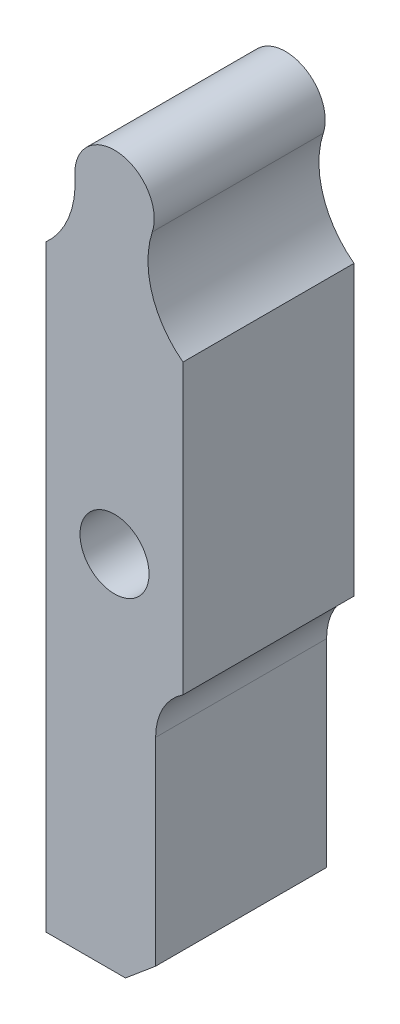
ISO-10303-21;
HEADER;
FILE_DESCRIPTION(('STEP AP214'),'2;1');
FILE_NAME('part.step','',(''),(''),'','','');
FILE_SCHEMA(('AUTOMOTIVE_DESIGN { 1 0 10303 214 1 1 1 1 }'));
ENDSEC;
DATA;
#1=APPLICATION_CONTEXT('core data for automotive mechanical design processes');
#2=APPLICATION_PROTOCOL_DEFINITION('international standard','automotive_design',2000,#1);
#3=PRODUCT_CONTEXT('',#1,'mechanical');
#4=PRODUCT('Part','Part','',(#3));
#5=PRODUCT_RELATED_PRODUCT_CATEGORY('part','',(#4));
#6=PRODUCT_DEFINITION_FORMATION('','',#4);
#7=PRODUCT_DEFINITION_CONTEXT('part definition',#1,'design');
#8=PRODUCT_DEFINITION('design','',#6,#7);
#9=PRODUCT_DEFINITION_SHAPE('','',#8);
#10=(LENGTH_UNIT() NAMED_UNIT(*) SI_UNIT(.MILLI.,.METRE.));
#11=(NAMED_UNIT(*) PLANE_ANGLE_UNIT() SI_UNIT($,.RADIAN.));
#12=(NAMED_UNIT(*) SI_UNIT($,.STERADIAN.) SOLID_ANGLE_UNIT());
#13=UNCERTAINTY_MEASURE_WITH_UNIT(LENGTH_MEASURE(1.E-05),#10,'distance_accuracy_value','');
#14=(GEOMETRIC_REPRESENTATION_CONTEXT(3) GLOBAL_UNCERTAINTY_ASSIGNED_CONTEXT((#13)) GLOBAL_UNIT_ASSIGNED_CONTEXT((#10,
#11,#12)) REPRESENTATION_CONTEXT('',''));
#15=CARTESIAN_POINT('',(0.,0.,0.));
#16=DIRECTION('',(0.,0.,1.));
#17=DIRECTION('',(1.,0.,0.));
#18=AXIS2_PLACEMENT_3D('',#15,#16,#17);
#19=CARTESIAN_POINT('',(4.699,10.3582357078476,3.9624));
#20=DIRECTION('',(0.,0.,-1.));
#21=DIRECTION('',(-1.,0.,0.));
#22=AXIS2_PLACEMENT_3D('',#19,#20,#21);
#23=PLANE('',#22);
#24=DIRECTION('',(0.766044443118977,0.642787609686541,0.));
#25=VECTOR('',#24,1.);
#26=CARTESIAN_POINT('',(0.508,0.,3.9624));
#27=LINE('',#26,#25);
#28=CARTESIAN_POINT('',(0.508,0.,3.9624));
#29=VERTEX_POINT('',#28);
#30=CARTESIAN_POINT('',(1.905,1.17222218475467,3.9624));
#31=VERTEX_POINT('',#30);
#32=EDGE_CURVE('E153',#29,#31,#27,.T.);
#33=ORIENTED_EDGE('',*,*,#32,.T.);
#34=DIRECTION('',(0.,1.,0.));
#35=VECTOR('',#34,1.);
#36=CARTESIAN_POINT('',(1.905,1.17222218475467,3.9624));
#37=LINE('',#36,#35);
#38=CARTESIAN_POINT('',(1.905,10.3582357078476,3.9624));
#39=VERTEX_POINT('',#38);
#40=EDGE_CURVE('E96',#31,#39,#37,.T.);
#41=ORIENTED_EDGE('',*,*,#40,.T.);
#42=CARTESIAN_POINT('',(4.699,10.3582357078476,3.9624));
#43=DIRECTION('',(0.,0.,-1.));
#44=DIRECTION('',(-1.,0.,0.));
#45=AXIS2_PLACEMENT_3D('',#42,#43,#44);
#46=CIRCLE('',#45,2.794);
#47=CARTESIAN_POINT('',(3.175,12.7,3.9624));
#48=VERTEX_POINT('',#47);
#49=EDGE_CURVE('E171',#39,#48,#46,.T.);
#50=ORIENTED_EDGE('',*,*,#49,.T.);
#51=DIRECTION('',(0.,1.,0.));
#52=VECTOR('',#51,1.);
#53=CARTESIAN_POINT('',(3.175,12.7,3.9624));
#54=LINE('',#53,#52);
#55=CARTESIAN_POINT('',(3.175,26.0604,3.9624));
#56=VERTEX_POINT('',#55);
#57=EDGE_CURVE('E188',#48,#56,#54,.T.);
#58=ORIENTED_EDGE('',*,*,#57,.T.);
#59=CARTESIAN_POINT('',(5.61484281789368,29.3105173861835,3.9624));
#60=DIRECTION('',(0.,0.,-1.));
#61=DIRECTION('',(1.,0.,0.));
#62=AXIS2_PLACEMENT_3D('',#59,#60,#61);
#63=CIRCLE('',#62,4.064);
#64=CARTESIAN_POINT('',(1.75086496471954,30.5697914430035,3.9624));
#65=VERTEX_POINT('',#64);
#66=EDGE_CURVE('E187',#56,#65,#63,.T.);
#67=ORIENTED_EDGE('',*,*,#66,.T.);
#68=CARTESIAN_POINT('',(0.,31.1404,3.9624));
#69=DIRECTION('',(0.,0.,1.));
#70=DIRECTION('',(-1.,0.,0.));
#71=AXIS2_PLACEMENT_3D('',#68,#69,#70);
#72=CIRCLE('',#71,1.8415);
#73=CARTESIAN_POINT('',(-1.83713638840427,31.0137029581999,3.9624));
#74=VERTEX_POINT('',#73);
#75=EDGE_CURVE('E118',#65,#74,#72,.T.);
#76=ORIENTED_EDGE('',*,*,#75,.T.);
#77=CARTESIAN_POINT('',(-5.8915063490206,30.7340956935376,3.9624));
#78=DIRECTION('',(0.,0.,-1.));
#79=DIRECTION('',(-1.,0.,0.));
#80=AXIS2_PLACEMENT_3D('',#77,#78,#79);
#81=CIRCLE('',#80,4.064);
#82=CARTESIAN_POINT('',(-3.175,27.7114,3.9624));
#83=VERTEX_POINT('',#82);
#84=EDGE_CURVE('E112',#74,#83,#81,.T.);
#85=ORIENTED_EDGE('',*,*,#84,.T.);
#86=DIRECTION('',(0.,-1.,0.));
#87=VECTOR('',#86,1.);
#88=CARTESIAN_POINT('',(-3.175,0.,3.9624));
#89=LINE('',#88,#87);
#90=CARTESIAN_POINT('',(-3.175,0.,3.9624));
#91=VERTEX_POINT('',#90);
#92=EDGE_CURVE('E116',#83,#91,#89,.T.);
#93=ORIENTED_EDGE('',*,*,#92,.T.);
#94=DIRECTION('',(1.,0.,0.));
#95=VECTOR('',#94,1.);
#96=CARTESIAN_POINT('',(-3.175,0.,3.9624));
#97=LINE('',#96,#95);
#98=EDGE_CURVE('E50',#91,#29,#97,.T.);
#99=ORIENTED_EDGE('',*,*,#98,.T.);
#100=EDGE_LOOP('',(#33,#41,#50,#58,#67,#76,#85,#93,#99));
#101=FACE_BOUND('',#100,.T.);
#102=CARTESIAN_POINT('',(0.,16.764,3.9624));
#103=DIRECTION('',(0.,0.,1.));
#104=DIRECTION('',(1.,0.,0.));
#105=AXIS2_PLACEMENT_3D('',#102,#103,#104);
#106=CIRCLE('',#105,1.6002);
#107=CARTESIAN_POINT('',(1.6002,16.764,3.9624));
#108=VERTEX_POINT('',#107);
#109=EDGE_CURVE('E140',#108,#108,#106,.T.);
#110=ORIENTED_EDGE('',*,*,#109,.F.);
#111=EDGE_LOOP('',(#110));
#112=FACE_BOUND('',#111,.T.);
#113=ADVANCED_FACE('F33',(#101,#112),#23,.F.);
#114=CARTESIAN_POINT('',(4.699,10.3582357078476,-3.9624));
#115=DIRECTION('',(0.,0.,-1.));
#116=DIRECTION('',(-1.,0.,0.));
#117=AXIS2_PLACEMENT_3D('',#114,#115,#116);
#118=PLANE('',#117);
#119=DIRECTION('',(0.766044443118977,0.642787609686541,0.));
#120=VECTOR('',#119,1.);
#121=CARTESIAN_POINT('',(0.508,0.,-3.9624));
#122=LINE('',#121,#120);
#123=CARTESIAN_POINT('',(0.508,0.,-3.9624));
#124=VERTEX_POINT('',#123);
#125=CARTESIAN_POINT('',(1.905,1.17222218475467,-3.9624));
#126=VERTEX_POINT('',#125);
#127=EDGE_CURVE('E136',#124,#126,#122,.T.);
#128=ORIENTED_EDGE('',*,*,#127,.F.);
#129=DIRECTION('',(1.,0.,0.));
#130=VECTOR('',#129,1.);
#131=CARTESIAN_POINT('',(-3.175,0.,-3.9624));
#132=LINE('',#131,#130);
#133=CARTESIAN_POINT('',(-3.175,0.,-3.9624));
#134=VERTEX_POINT('',#133);
#135=EDGE_CURVE('E88',#134,#124,#132,.T.);
#136=ORIENTED_EDGE('',*,*,#135,.F.);
#137=DIRECTION('',(0.,-1.,0.));
#138=VECTOR('',#137,1.);
#139=CARTESIAN_POINT('',(-3.175,0.,-3.9624));
#140=LINE('',#139,#138);
#141=CARTESIAN_POINT('',(-3.175,27.7114,-3.9624));
#142=VERTEX_POINT('',#141);
#143=EDGE_CURVE('E82',#142,#134,#140,.T.);
#144=ORIENTED_EDGE('',*,*,#143,.F.);
#145=CARTESIAN_POINT('',(-5.8915063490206,30.7340956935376,-3.9624));
#146=DIRECTION('',(0.,0.,-1.));
#147=DIRECTION('',(-1.,0.,0.));
#148=AXIS2_PLACEMENT_3D('',#145,#146,#147);
#149=CIRCLE('',#148,4.064);
#150=CARTESIAN_POINT('',(-1.83713638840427,31.0137029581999,-3.9624));
#151=VERTEX_POINT('',#150);
#152=EDGE_CURVE('E126',#151,#142,#149,.T.);
#153=ORIENTED_EDGE('',*,*,#152,.F.);
#154=CARTESIAN_POINT('',(0.,31.1404,-3.9624));
#155=DIRECTION('',(0.,0.,1.));
#156=DIRECTION('',(-1.,0.,0.));
#157=AXIS2_PLACEMENT_3D('',#154,#155,#156);
#158=CIRCLE('',#157,1.8415);
#159=CARTESIAN_POINT('',(1.75086496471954,30.5697914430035,-3.9624));
#160=VERTEX_POINT('',#159);
#161=EDGE_CURVE('E148',#160,#151,#158,.T.);
#162=ORIENTED_EDGE('',*,*,#161,.F.);
#163=CARTESIAN_POINT('',(5.61484281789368,29.3105173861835,-3.9624));
#164=DIRECTION('',(0.,0.,-1.));
#165=DIRECTION('',(1.,0.,0.));
#166=AXIS2_PLACEMENT_3D('',#163,#164,#165);
#167=CIRCLE('',#166,4.064);
#168=CARTESIAN_POINT('',(3.175,26.0604,-3.9624));
#169=VERTEX_POINT('',#168);
#170=EDGE_CURVE('E146',#169,#160,#167,.T.);
#171=ORIENTED_EDGE('',*,*,#170,.F.);
#172=DIRECTION('',(0.,1.,0.));
#173=VECTOR('',#172,1.);
#174=CARTESIAN_POINT('',(3.175,12.7,-3.9624));
#175=LINE('',#174,#173);
#176=CARTESIAN_POINT('',(3.175,12.7,-3.9624));
#177=VERTEX_POINT('',#176);
#178=EDGE_CURVE('E144',#177,#169,#175,.T.);
#179=ORIENTED_EDGE('',*,*,#178,.F.);
#180=CARTESIAN_POINT('',(4.699,10.3582357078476,-3.9624));
#181=DIRECTION('',(0.,0.,-1.));
#182=DIRECTION('',(-1.,0.,0.));
#183=AXIS2_PLACEMENT_3D('',#180,#181,#182);
#184=CIRCLE('',#183,2.794);
#185=CARTESIAN_POINT('',(1.905,10.3582357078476,-3.9624));
#186=VERTEX_POINT('',#185);
#187=EDGE_CURVE('E142',#186,#177,#184,.T.);
#188=ORIENTED_EDGE('',*,*,#187,.F.);
#189=DIRECTION('',(0.,1.,0.));
#190=VECTOR('',#189,1.);
#191=CARTESIAN_POINT('',(1.905,1.17222218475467,-3.9624));
#192=LINE('',#191,#190);
#193=EDGE_CURVE('E139',#126,#186,#192,.T.);
#194=ORIENTED_EDGE('',*,*,#193,.F.);
#195=EDGE_LOOP('',(#128,#136,#144,#153,#162,#171,#179,#188,#194));
#196=FACE_BOUND('',#195,.T.);
#197=CARTESIAN_POINT('',(0.,16.764,-3.9624));
#198=DIRECTION('',(0.,0.,1.));
#199=DIRECTION('',(1.,0.,0.));
#200=AXIS2_PLACEMENT_3D('',#197,#198,#199);
#201=CIRCLE('',#200,1.6002);
#202=CARTESIAN_POINT('',(1.6002,16.764,-3.9624));
#203=VERTEX_POINT('',#202);
#204=EDGE_CURVE('E195',#203,#203,#201,.T.);
#205=ORIENTED_EDGE('',*,*,#204,.T.);
#206=EDGE_LOOP('',(#205));
#207=FACE_BOUND('',#206,.T.);
#208=ADVANCED_FACE('F175',(#196,#207),#118,.T.);
#209=CARTESIAN_POINT('',(0.508,0.,3.9624));
#210=DIRECTION('',(-0.642787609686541,0.766044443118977,0.));
#211=DIRECTION('',(-0.766044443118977,-0.642787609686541,0.));
#212=AXIS2_PLACEMENT_3D('',#209,#210,#211);
#213=PLANE('',#212);
#214=ORIENTED_EDGE('',*,*,#127,.T.);
#215=DIRECTION('',(0.,0.,-1.));
#216=VECTOR('',#215,1.);
#217=CARTESIAN_POINT('',(1.905,1.17222218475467,3.9624));
#218=LINE('',#217,#216);
#219=EDGE_CURVE('E11',#31,#126,#218,.T.);
#220=ORIENTED_EDGE('',*,*,#219,.F.);
#221=ORIENTED_EDGE('',*,*,#32,.F.);
#222=DIRECTION('',(0.,0.,-1.));
#223=VECTOR('',#222,1.);
#224=CARTESIAN_POINT('',(0.508,0.,3.9624));
#225=LINE('',#224,#223);
#226=EDGE_CURVE('E132',#29,#124,#225,.T.);
#227=ORIENTED_EDGE('',*,*,#226,.T.);
#228=EDGE_LOOP('',(#214,#220,#221,#227));
#229=FACE_BOUND('',#228,.T.);
#230=ADVANCED_FACE('F35',(#229),#213,.F.);
#231=CARTESIAN_POINT('',(1.905,1.17222218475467,3.9624));
#232=DIRECTION('',(-1.,0.,0.));
#233=DIRECTION('',(0.,-1.,0.));
#234=AXIS2_PLACEMENT_3D('',#231,#232,#233);
#235=PLANE('',#234);
#236=ORIENTED_EDGE('',*,*,#193,.T.);
#237=DIRECTION('',(0.,0.,-1.));
#238=VECTOR('',#237,1.);
#239=CARTESIAN_POINT('',(1.905,10.3582357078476,3.9624));
#240=LINE('',#239,#238);
#241=EDGE_CURVE('E42',#39,#186,#240,.T.);
#242=ORIENTED_EDGE('',*,*,#241,.F.);
#243=ORIENTED_EDGE('',*,*,#40,.F.);
#244=ORIENTED_EDGE('',*,*,#219,.T.);
#245=EDGE_LOOP('',(#236,#242,#243,#244));
#246=FACE_BOUND('',#245,.T.);
#247=ADVANCED_FACE('F227',(#246),#235,.F.);
#248=CARTESIAN_POINT('',(4.699,10.3582357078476,3.9624));
#249=DIRECTION('',(0.,0.,-1.));
#250=DIRECTION('',(-1.,0.,0.));
#251=AXIS2_PLACEMENT_3D('',#248,#249,#250);
#252=CYLINDRICAL_SURFACE('',#251,2.794);
#253=ORIENTED_EDGE('',*,*,#187,.T.);
#254=DIRECTION('',(0.,0.,-1.));
#255=VECTOR('',#254,1.);
#256=CARTESIAN_POINT('',(3.175,12.7,3.9624));
#257=LINE('',#256,#255);
#258=EDGE_CURVE('E163',#48,#177,#257,.T.);
#259=ORIENTED_EDGE('',*,*,#258,.F.);
#260=ORIENTED_EDGE('',*,*,#49,.F.);
#261=ORIENTED_EDGE('',*,*,#241,.T.);
#262=EDGE_LOOP('',(#253,#259,#260,#261));
#263=FACE_BOUND('',#262,.T.);
#264=ADVANCED_FACE('F169',(#263),#252,.F.);
#265=CARTESIAN_POINT('',(3.175,12.7,3.9624));
#266=DIRECTION('',(-1.,0.,0.));
#267=DIRECTION('',(0.,0.,1.));
#268=AXIS2_PLACEMENT_3D('',#265,#266,#267);
#269=PLANE('',#268);
#270=ORIENTED_EDGE('',*,*,#178,.T.);
#271=DIRECTION('',(0.,0.,-1.));
#272=VECTOR('',#271,1.);
#273=CARTESIAN_POINT('',(3.175,26.0604,3.9624));
#274=LINE('',#273,#272);
#275=EDGE_CURVE('E160',#56,#169,#274,.T.);
#276=ORIENTED_EDGE('',*,*,#275,.F.);
#277=ORIENTED_EDGE('',*,*,#57,.F.);
#278=ORIENTED_EDGE('',*,*,#258,.T.);
#279=EDGE_LOOP('',(#270,#276,#277,#278));
#280=FACE_BOUND('',#279,.T.);
#281=ADVANCED_FACE('F181',(#280),#269,.F.);
#282=CARTESIAN_POINT('',(5.61484281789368,29.3105173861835,3.9624));
#283=DIRECTION('',(0.,0.,-1.));
#284=DIRECTION('',(-1.,0.,0.));
#285=AXIS2_PLACEMENT_3D('',#282,#283,#284);
#286=CYLINDRICAL_SURFACE('',#285,4.064);
#287=ORIENTED_EDGE('',*,*,#170,.T.);
#288=DIRECTION('',(0.,0.,-1.));
#289=VECTOR('',#288,1.);
#290=CARTESIAN_POINT('',(1.75086496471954,30.5697914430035,3.9624));
#291=LINE('',#290,#289);
#292=EDGE_CURVE('E157',#65,#160,#291,.T.);
#293=ORIENTED_EDGE('',*,*,#292,.F.);
#294=ORIENTED_EDGE('',*,*,#66,.F.);
#295=ORIENTED_EDGE('',*,*,#275,.T.);
#296=EDGE_LOOP('',(#287,#293,#294,#295));
#297=FACE_BOUND('',#296,.T.);
#298=ADVANCED_FACE('F185',(#297),#286,.F.);
#299=CARTESIAN_POINT('',(0.,31.1404,3.9624));
#300=DIRECTION('',(0.,0.,-1.));
#301=DIRECTION('',(-1.,0.,0.));
#302=AXIS2_PLACEMENT_3D('',#299,#300,#301);
#303=CYLINDRICAL_SURFACE('',#302,1.8415);
#304=ORIENTED_EDGE('',*,*,#161,.T.);
#305=DIRECTION('',(0.,0.,-1.));
#306=VECTOR('',#305,1.);
#307=CARTESIAN_POINT('',(-1.83713638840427,31.0137029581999,3.9624));
#308=LINE('',#307,#306);
#309=EDGE_CURVE('E127',#74,#151,#308,.T.);
#310=ORIENTED_EDGE('',*,*,#309,.F.);
#311=ORIENTED_EDGE('',*,*,#75,.F.);
#312=ORIENTED_EDGE('',*,*,#292,.T.);
#313=EDGE_LOOP('',(#304,#310,#311,#312));
#314=FACE_BOUND('',#313,.T.);
#315=ADVANCED_FACE('F218',(#314),#303,.T.);
#316=CARTESIAN_POINT('',(-5.8915063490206,30.7340956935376,3.9624));
#317=DIRECTION('',(0.,0.,-1.));
#318=DIRECTION('',(-1.,0.,0.));
#319=AXIS2_PLACEMENT_3D('',#316,#317,#318);
#320=CYLINDRICAL_SURFACE('',#319,4.064);
#321=ORIENTED_EDGE('',*,*,#152,.T.);
#322=DIRECTION('',(0.,0.,-1.));
#323=VECTOR('',#322,1.);
#324=CARTESIAN_POINT('',(-3.175,27.7114,3.9624));
#325=LINE('',#324,#323);
#326=EDGE_CURVE('E123',#83,#142,#325,.T.);
#327=ORIENTED_EDGE('',*,*,#326,.F.);
#328=ORIENTED_EDGE('',*,*,#84,.F.);
#329=ORIENTED_EDGE('',*,*,#309,.T.);
#330=EDGE_LOOP('',(#321,#327,#328,#329));
#331=FACE_BOUND('',#330,.T.);
#332=ADVANCED_FACE('F124',(#331),#320,.F.);
#333=CARTESIAN_POINT('',(-3.175,0.,3.9624));
#334=DIRECTION('',(1.,0.,0.));
#335=DIRECTION('',(0.,1.,0.));
#336=AXIS2_PLACEMENT_3D('',#333,#334,#335);
#337=PLANE('',#336);
#338=ORIENTED_EDGE('',*,*,#143,.T.);
#339=DIRECTION('',(0.,0.,-1.));
#340=VECTOR('',#339,1.);
#341=CARTESIAN_POINT('',(-3.175,0.,3.9624));
#342=LINE('',#341,#340);
#343=EDGE_CURVE('E128',#91,#134,#342,.T.);
#344=ORIENTED_EDGE('',*,*,#343,.F.);
#345=ORIENTED_EDGE('',*,*,#92,.F.);
#346=ORIENTED_EDGE('',*,*,#326,.T.);
#347=EDGE_LOOP('',(#338,#344,#345,#346));
#348=FACE_BOUND('',#347,.T.);
#349=ADVANCED_FACE('F130',(#348),#337,.F.);
#350=CARTESIAN_POINT('',(-3.175,0.,3.9624));
#351=DIRECTION('',(0.,1.,0.));
#352=DIRECTION('',(0.,0.,1.));
#353=AXIS2_PLACEMENT_3D('',#350,#351,#352);
#354=PLANE('',#353);
#355=ORIENTED_EDGE('',*,*,#135,.T.);
#356=ORIENTED_EDGE('',*,*,#226,.F.);
#357=ORIENTED_EDGE('',*,*,#98,.F.);
#358=ORIENTED_EDGE('',*,*,#343,.T.);
#359=EDGE_LOOP('',(#355,#356,#357,#358));
#360=FACE_BOUND('',#359,.T.);
#361=ADVANCED_FACE('F211',(#360),#354,.F.);
#362=CARTESIAN_POINT('',(0.,16.764,3.9624));
#363=DIRECTION('',(0.,0.,-1.));
#364=DIRECTION('',(-1.,0.,0.));
#365=AXIS2_PLACEMENT_3D('',#362,#363,#364);
#366=CYLINDRICAL_SURFACE('',#365,1.6002);
#367=ORIENTED_EDGE('',*,*,#109,.T.);
#368=EDGE_LOOP('',(#367));
#369=FACE_BOUND('',#368,.T.);
#370=ORIENTED_EDGE('',*,*,#204,.F.);
#371=EDGE_LOOP('',(#370));
#372=FACE_BOUND('',#371,.T.);
#373=ADVANCED_FACE('F201',(#369,#372),#366,.F.);
#374=CLOSED_SHELL('',(#113,#208,#230,#247,#264,#281,#298,#315,#332,#349,#361,#373));
#375=MANIFOLD_SOLID_BREP('B2',#374);
#376=ADVANCED_BREP_SHAPE_REPRESENTATION('',(#18,#375),#14);
#377=SHAPE_DEFINITION_REPRESENTATION(#9,#376);
ENDSEC;
END-ISO-10303-21;
